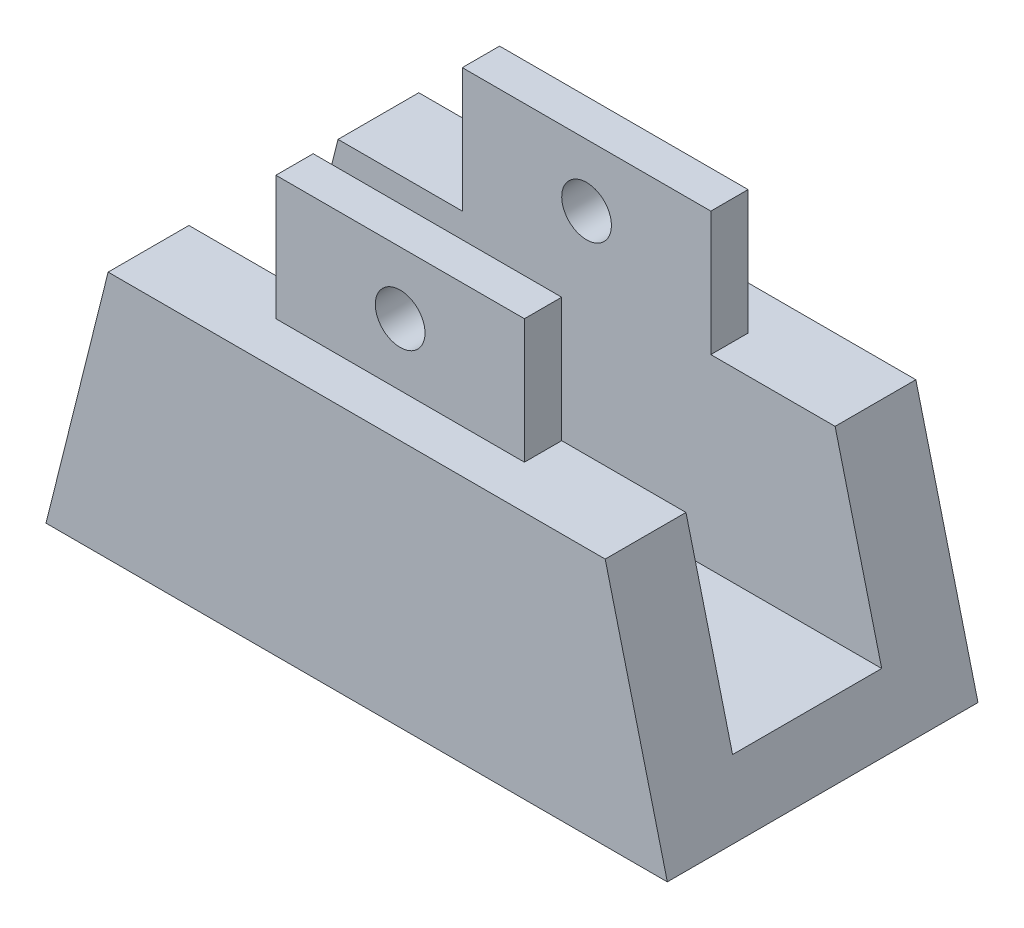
from build123d import *

# Parameters (mm, degrees)
SKETCH1_W           = 20
SKETCH1_H           = 10
SKETCH1_R           = 2
EXTRUDE1_DEPTH      = 9
SKETCH2_W           = 12
SKETCH2_H           = 10
EXTRUDE2_DEPTH      = 25.103941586
EXTRUDE3_DEPTH      = 12.5
EXTRUDE4_DEPTH      = 6
EXTRUDE5_DEPTH      = 43.20485754
EXTRUDE5_DEPTH_BACK = 43.20485754
SKETCH5_W           = 12
SKETCH5_H           = 25


with BuildPart() as part:
    # Sketch1 → Extrude1 (new, symmetric)
    with BuildSketch(Plane.XY):
        with Locations((10, 5)):
            Rectangle(SKETCH1_W, SKETCH1_H)
        with Locations((10, 5)):
            Circle(SKETCH1_R, mode=Mode.SUBTRACT)
    extrude(amount=EXTRUDE1_DEPTH, both=True)

    # Sketch2 → Extrude2 (cut, through all)
    with BuildSketch(Plane.ZY):
        with Locations((0, 5)):
            Rectangle(SKETCH2_W, SKETCH2_H)
    extrude(amount=-EXTRUDE2_DEPTH, mode=Mode.SUBTRACT)


with BuildPart() as extrude2_piece_1:
    # of the separate pieces the step leaves, piece 1, a body of its own (extrude2_pieces)
    add(part.part.solids().sort_by_distance((0, 0, -6))[0])



with BuildPart() as extrude2_piece_2:
    # of the separate pieces the step leaves, piece 2, a body of its own (extrude2_pieces)
    add(part.part.solids().sort_by_distance((0, 0, 9))[0])


with BuildPart() as extrude2_piece_1_1:
    add(extrude2_piece_1.part)

    add(extrude2_piece_2.part)  # Extrude3 merges Extrude2 piece 2
    # Sketch3 → Extrude3 (add, symmetric)
    with BuildSketch(Plane.XY):
        Polygon((-10, 0), (30, 0), (35, -20), (-15, -20), align=None)
    extrude(amount=EXTRUDE3_DEPTH, both=True)

    # Sketch4 → Extrude4 (cut, symmetric)
    with BuildSketch(Plane.XY):
        Polygon((-12, -8), (10, 0), (-10, 0), align=None)
    extrude(amount=EXTRUDE4_DEPTH, both=True, mode=Mode.SUBTRACT)

    # Sketch5 → Extrude5 (cut, two sides: drawn at the far end of the back side and taken through both)
    with BuildSketch(Plane(origin=(0, 0, 0), x_dir=(0, 0, -1), z_dir=(1, 0, 0)).offset(-EXTRUDE5_DEPTH_BACK)):
        with Locations((0, -2.5)):
            Rectangle(SKETCH5_W, SKETCH5_H)
    extrude(amount=EXTRUDE5_DEPTH + EXTRUDE5_DEPTH_BACK, mode=Mode.SUBTRACT)


solid = extrude2_piece_1_1.part
